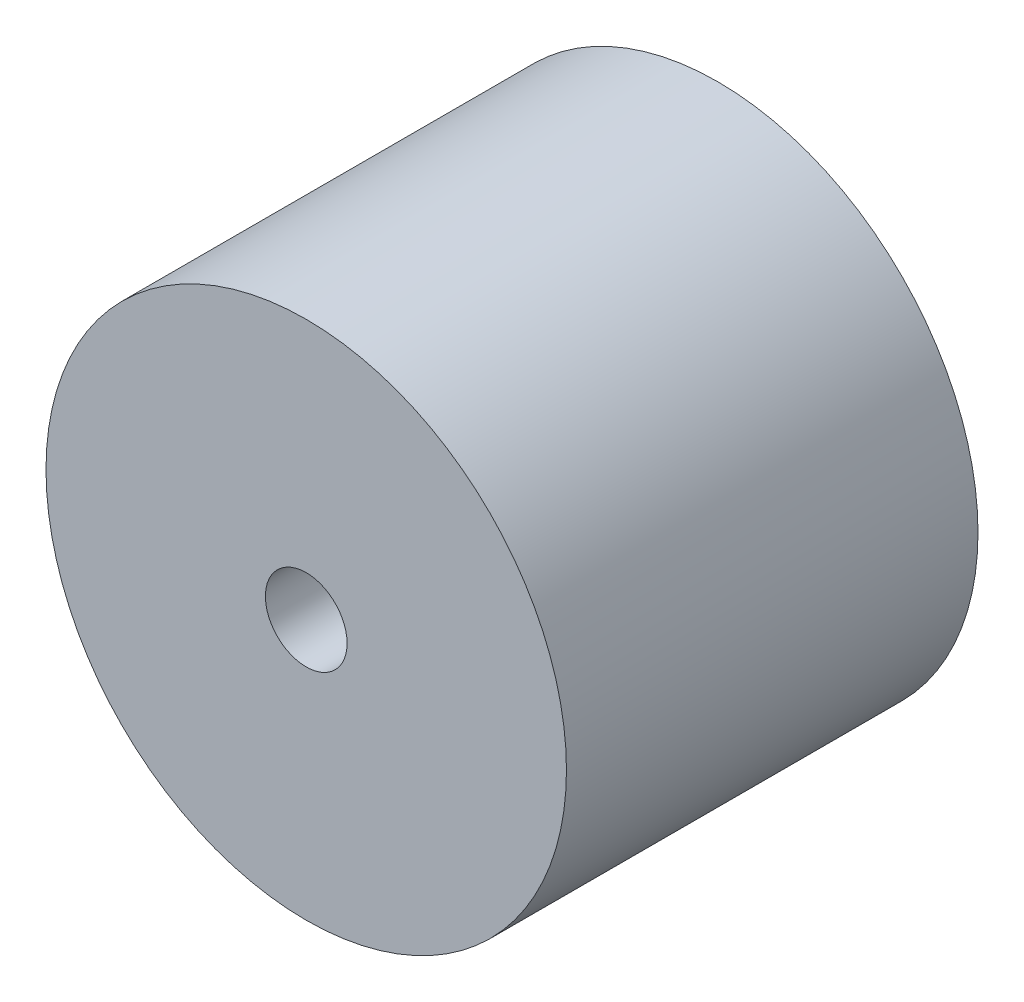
from build123d import *

# Parameters (mm, degrees)
ESQUISSE1_R        = 43
ESQUISSE1_R_2      = 6.75
BOSS_EXTRU_1_DEPTH = 34


with BuildPart() as part:
    # Esquisse1 → Boss.-Extru.1 (new, symmetric)
    with BuildSketch(Plane.XY):
        Circle(ESQUISSE1_R)
        Circle(ESQUISSE1_R_2, mode=Mode.SUBTRACT)
    extrude(amount=BOSS_EXTRU_1_DEPTH, both=True)


solid = part.part
